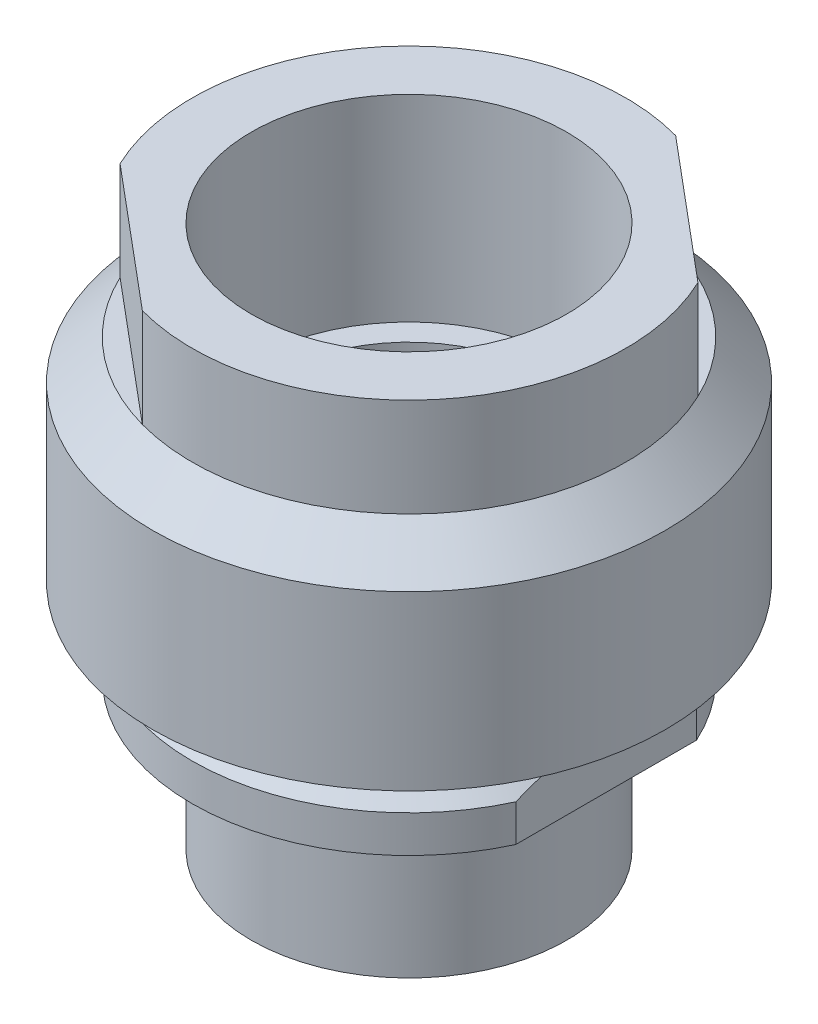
from build123d import *

# Parameters (mm, degrees)
TAGLIO_ESTRUSIONE1_START = -20
TAGLIO_ESTRUSIONE1_DEPTH = 20
TAGLIO_ESTRUSIONE2_DEPTH = 10


with BuildPart() as part:
    # Schizzo1 → Rivoluzione1 (revolve)
    with BuildSketch(Plane.XY, mode=Mode.PRIVATE) as rivoluzione1_sk:
        Polygon((16, 0), (22, 0), (22, 3.75), (18.75, 7), (18.75, 10.5), (23.5, 10.5), (23.5, 8.5), (26, 8.5), (26, 26), (22, 30), (22, 40), (16, 40), (16, 20), (13.5, 20), (13.5, -15), (16, -15), align=None)
    revolve(rivoluzione1_sk.sketch.rotate(Axis((0, 0, 0), (0, 1, 0)), 90), axis=Axis((0, 0, 0), (0, 1, 0)))

    # Schizzo5 → Taglio-Estrusione1 (cut)
    with BuildSketch(Plane.XZ.offset(TAGLIO_ESTRUSIONE1_START)):
        with BuildLine():
            Line((-20, 9.16515139), (-20, -9.16515139))
            ThreePointArc((-20, -9.16515139), (-22, 0), (-20, 9.16515139))
        make_face()
        with BuildLine():
            Line((20, 9.16515139), (20, -9.16515139))
            ThreePointArc((20, -9.16515139), (22, 0), (20, 9.16515139))
        make_face()
    extrude(amount=TAGLIO_ESTRUSIONE1_DEPTH, mode=Mode.SUBTRACT)

    # Schizzo6 → Taglio-Estrusione2 (cut)
    with BuildSketch(Plane(origin=(0, 40, 0), x_dir=(1, 0, 0), z_dir=(0, 1, 0))):
        with BuildLine():
            Line((5.834838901, 21.212134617), (19.876665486, 9.429643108))
            ThreePointArc((19.876665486, 9.429643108), (14.141327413, 16.852977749), (5.834838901, 21.212134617))
        make_face()
        with BuildLine():
            Line((-19.876665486, -9.429643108), (-5.834838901, -21.212134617))
            ThreePointArc((-5.834838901, -21.212134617), (-14.141327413, -16.852977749), (-19.876665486, -9.429643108))
        make_face()
    extrude(amount=-TAGLIO_ESTRUSIONE2_DEPTH, mode=Mode.SUBTRACT)


solid = part.part
